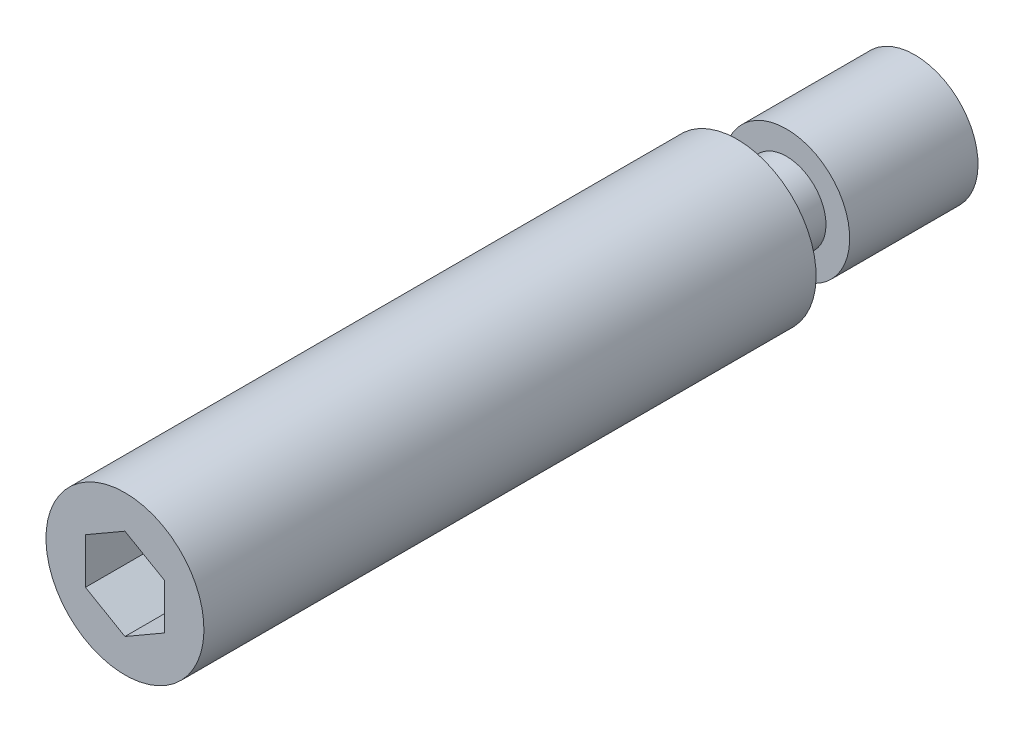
ISO-10303-21;
HEADER;
FILE_DESCRIPTION(('STEP AP214'),'2;1');
FILE_NAME('part.step','',(''),(''),'','','');
FILE_SCHEMA(('AUTOMOTIVE_DESIGN { 1 0 10303 214 1 1 1 1 }'));
ENDSEC;
DATA;
#1=APPLICATION_CONTEXT('core data for automotive mechanical design processes');
#2=APPLICATION_PROTOCOL_DEFINITION('international standard','automotive_design',2000,#1);
#3=PRODUCT_CONTEXT('',#1,'mechanical');
#4=PRODUCT('Part','Part','',(#3));
#5=PRODUCT_RELATED_PRODUCT_CATEGORY('part','',(#4));
#6=PRODUCT_DEFINITION_FORMATION('','',#4);
#7=PRODUCT_DEFINITION_CONTEXT('part definition',#1,'design');
#8=PRODUCT_DEFINITION('design','',#6,#7);
#9=PRODUCT_DEFINITION_SHAPE('','',#8);
#10=(LENGTH_UNIT() NAMED_UNIT(*) SI_UNIT(.MILLI.,.METRE.));
#11=(NAMED_UNIT(*) PLANE_ANGLE_UNIT() SI_UNIT($,.RADIAN.));
#12=(NAMED_UNIT(*) SI_UNIT($,.STERADIAN.) SOLID_ANGLE_UNIT());
#13=UNCERTAINTY_MEASURE_WITH_UNIT(LENGTH_MEASURE(1.E-05),#10,'distance_accuracy_value','');
#14=(GEOMETRIC_REPRESENTATION_CONTEXT(3) GLOBAL_UNCERTAINTY_ASSIGNED_CONTEXT((#13)) GLOBAL_UNIT_ASSIGNED_CONTEXT((#10,
#11,#12)) REPRESENTATION_CONTEXT('',''));
#15=CARTESIAN_POINT('',(0.,0.,0.));
#16=DIRECTION('',(0.,0.,1.));
#17=DIRECTION('',(1.,0.,0.));
#18=AXIS2_PLACEMENT_3D('',#15,#16,#17);
#19=CARTESIAN_POINT('',(0.,-4.,9.));
#20=DIRECTION('',(0.,0.,-1.));
#21=DIRECTION('',(0.,-1.,0.));
#22=AXIS2_PLACEMENT_3D('',#19,#20,#21);
#23=PLANE('',#22);
#24=CARTESIAN_POINT('',(0.,0.,9.));
#25=DIRECTION('',(0.,0.,1.));
#26=DIRECTION('',(0.,1.,0.));
#27=AXIS2_PLACEMENT_3D('',#24,#25,#26);
#28=CIRCLE('',#27,2.);
#29=CARTESIAN_POINT('',(0.,2.,9.));
#30=VERTEX_POINT('',#29);
#31=EDGE_CURVE('E115',#30,#30,#28,.T.);
#32=ORIENTED_EDGE('',*,*,#31,.T.);
#33=EDGE_LOOP('',(#32));
#34=FACE_BOUND('',#33,.T.);
#35=CARTESIAN_POINT('',(0.,0.,9.));
#36=DIRECTION('',(0.,0.,1.));
#37=DIRECTION('',(0.,1.,0.));
#38=AXIS2_PLACEMENT_3D('',#35,#36,#37);
#39=CIRCLE('',#38,4.);
#40=CARTESIAN_POINT('',(0.,4.,9.));
#41=VERTEX_POINT('',#40);
#42=EDGE_CURVE('E9',#41,#41,#39,.T.);
#43=ORIENTED_EDGE('',*,*,#42,.F.);
#44=EDGE_LOOP('',(#43));
#45=FACE_BOUND('',#44,.T.);
#46=ADVANCED_FACE('F14',(#34,#45),#23,.T.);
#47=CARTESIAN_POINT('',(0.,0.,20.));
#48=DIRECTION('',(0.,0.,1.));
#49=DIRECTION('',(0.,1.,0.));
#50=AXIS2_PLACEMENT_3D('',#47,#48,#49);
#51=CYLINDRICAL_SURFACE('',#50,4.);
#52=CARTESIAN_POINT('',(0.,0.,40.));
#53=DIRECTION('',(0.,0.,1.));
#54=DIRECTION('',(0.,1.,0.));
#55=AXIS2_PLACEMENT_3D('',#52,#53,#54);
#56=CIRCLE('',#55,4.);
#57=CARTESIAN_POINT('',(0.,4.,40.));
#58=VERTEX_POINT('',#57);
#59=EDGE_CURVE('E21',#58,#58,#56,.T.);
#60=ORIENTED_EDGE('',*,*,#59,.F.);
#61=EDGE_LOOP('',(#60));
#62=FACE_BOUND('',#61,.T.);
#63=ORIENTED_EDGE('',*,*,#42,.T.);
#64=EDGE_LOOP('',(#63));
#65=FACE_BOUND('',#64,.T.);
#66=ADVANCED_FACE('F136',(#62,#65),#51,.T.);
#67=CARTESIAN_POINT('',(0.,-4.,40.));
#68=DIRECTION('',(0.,0.,-1.));
#69=DIRECTION('',(0.,-1.,0.));
#70=AXIS2_PLACEMENT_3D('',#67,#68,#69);
#71=PLANE('',#70);
#72=DIRECTION('',(-0.866025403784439,-0.5,0.));
#73=VECTOR('',#72,1.);
#74=CARTESIAN_POINT('',(0.,2.30940107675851,40.));
#75=LINE('',#74,#73);
#76=CARTESIAN_POINT('',(0.,2.30940107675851,40.));
#77=VERTEX_POINT('',#76);
#78=CARTESIAN_POINT('',(-2.,1.15470053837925,40.));
#79=VERTEX_POINT('',#78);
#80=EDGE_CURVE('E102',#77,#79,#75,.T.);
#81=ORIENTED_EDGE('',*,*,#80,.F.);
#82=DIRECTION('',(-0.866025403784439,0.5,0.));
#83=VECTOR('',#82,1.);
#84=CARTESIAN_POINT('',(2.,1.15470053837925,40.));
#85=LINE('',#84,#83);
#86=CARTESIAN_POINT('',(2.,1.15470053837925,40.));
#87=VERTEX_POINT('',#86);
#88=EDGE_CURVE('E28',#87,#77,#85,.T.);
#89=ORIENTED_EDGE('',*,*,#88,.F.);
#90=DIRECTION('',(0.,1.,0.));
#91=VECTOR('',#90,1.);
#92=CARTESIAN_POINT('',(2.,-1.15470053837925,40.));
#93=LINE('',#92,#91);
#94=CARTESIAN_POINT('',(2.,-1.15470053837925,40.));
#95=VERTEX_POINT('',#94);
#96=EDGE_CURVE('E111',#95,#87,#93,.T.);
#97=ORIENTED_EDGE('',*,*,#96,.F.);
#98=DIRECTION('',(0.866025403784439,0.5,0.));
#99=VECTOR('',#98,1.);
#100=CARTESIAN_POINT('',(0.,-2.30940107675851,40.));
#101=LINE('',#100,#99);
#102=CARTESIAN_POINT('',(0.,-2.30940107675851,40.));
#103=VERTEX_POINT('',#102);
#104=EDGE_CURVE('E109',#103,#95,#101,.T.);
#105=ORIENTED_EDGE('',*,*,#104,.F.);
#106=DIRECTION('',(0.866025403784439,-0.5,0.));
#107=VECTOR('',#106,1.);
#108=CARTESIAN_POINT('',(-2.,-1.15470053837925,40.));
#109=LINE('',#108,#107);
#110=CARTESIAN_POINT('',(-2.,-1.15470053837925,40.));
#111=VERTEX_POINT('',#110);
#112=EDGE_CURVE('E76',#111,#103,#109,.T.);
#113=ORIENTED_EDGE('',*,*,#112,.F.);
#114=DIRECTION('',(0.,-1.,0.));
#115=VECTOR('',#114,1.);
#116=CARTESIAN_POINT('',(-2.,1.15470053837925,40.));
#117=LINE('',#116,#115);
#118=EDGE_CURVE('E105',#79,#111,#117,.T.);
#119=ORIENTED_EDGE('',*,*,#118,.F.);
#120=EDGE_LOOP('',(#81,#89,#97,#105,#113,#119));
#121=FACE_BOUND('',#120,.T.);
#122=ORIENTED_EDGE('',*,*,#59,.T.);
#123=EDGE_LOOP('',(#122));
#124=FACE_BOUND('',#123,.T.);
#125=ADVANCED_FACE('F134',(#121,#124),#71,.F.);
#126=CARTESIAN_POINT('',(0.,-3.2,0.));
#127=DIRECTION('',(0.,0.,-1.));
#128=DIRECTION('',(0.,-1.,0.));
#129=AXIS2_PLACEMENT_3D('',#126,#127,#128);
#130=PLANE('',#129);
#131=CARTESIAN_POINT('',(0.,0.,0.));
#132=DIRECTION('',(0.,0.,1.));
#133=DIRECTION('',(0.,1.,0.));
#134=AXIS2_PLACEMENT_3D('',#131,#132,#133);
#135=CIRCLE('',#134,3.2);
#136=CARTESIAN_POINT('',(0.,3.2,0.));
#137=VERTEX_POINT('',#136);
#138=EDGE_CURVE('E129',#137,#137,#135,.T.);
#139=ORIENTED_EDGE('',*,*,#138,.F.);
#140=EDGE_LOOP('',(#139));
#141=FACE_BOUND('',#140,.T.);
#142=ADVANCED_FACE('F167',(#141),#130,.T.);
#143=CARTESIAN_POINT('',(0.,0.,20.));
#144=DIRECTION('',(0.,0.,1.));
#145=DIRECTION('',(0.,1.,0.));
#146=AXIS2_PLACEMENT_3D('',#143,#144,#145);
#147=CYLINDRICAL_SURFACE('',#146,3.2);
#148=ORIENTED_EDGE('',*,*,#138,.T.);
#149=EDGE_LOOP('',(#148));
#150=FACE_BOUND('',#149,.T.);
#151=CARTESIAN_POINT('',(0.,0.,6.5));
#152=DIRECTION('',(0.,0.,1.));
#153=DIRECTION('',(0.,1.,0.));
#154=AXIS2_PLACEMENT_3D('',#151,#152,#153);
#155=CIRCLE('',#154,3.2);
#156=CARTESIAN_POINT('',(0.,3.2,6.5));
#157=VERTEX_POINT('',#156);
#158=EDGE_CURVE('E126',#157,#157,#155,.T.);
#159=ORIENTED_EDGE('',*,*,#158,.F.);
#160=EDGE_LOOP('',(#159));
#161=FACE_BOUND('',#160,.T.);
#162=ADVANCED_FACE('F160',(#150,#161),#147,.T.);
#163=CARTESIAN_POINT('',(0.,-2.,6.5));
#164=DIRECTION('',(0.,0.,1.));
#165=DIRECTION('',(0.,1.,0.));
#166=AXIS2_PLACEMENT_3D('',#163,#164,#165);
#167=PLANE('',#166);
#168=ORIENTED_EDGE('',*,*,#158,.T.);
#169=EDGE_LOOP('',(#168));
#170=FACE_BOUND('',#169,.T.);
#171=CARTESIAN_POINT('',(0.,0.,6.5));
#172=DIRECTION('',(0.,0.,1.));
#173=DIRECTION('',(0.,1.,0.));
#174=AXIS2_PLACEMENT_3D('',#171,#172,#173);
#175=CIRCLE('',#174,2.);
#176=CARTESIAN_POINT('',(0.,2.,6.5));
#177=VERTEX_POINT('',#176);
#178=EDGE_CURVE('E123',#177,#177,#175,.T.);
#179=ORIENTED_EDGE('',*,*,#178,.F.);
#180=EDGE_LOOP('',(#179));
#181=FACE_BOUND('',#180,.T.);
#182=ADVANCED_FACE('F151',(#170,#181),#167,.T.);
#183=CARTESIAN_POINT('',(0.,0.,20.));
#184=DIRECTION('',(0.,0.,1.));
#185=DIRECTION('',(0.,1.,0.));
#186=AXIS2_PLACEMENT_3D('',#183,#184,#185);
#187=CYLINDRICAL_SURFACE('',#186,2.);
#188=ORIENTED_EDGE('',*,*,#178,.T.);
#189=EDGE_LOOP('',(#188));
#190=FACE_BOUND('',#189,.T.);
#191=ORIENTED_EDGE('',*,*,#31,.F.);
#192=EDGE_LOOP('',(#191));
#193=FACE_BOUND('',#192,.T.);
#194=ADVANCED_FACE('F148',(#190,#193),#187,.T.);
#195=CARTESIAN_POINT('',(2.,1.15470053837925,35.));
#196=DIRECTION('',(0.5,0.866025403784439,0.));
#197=DIRECTION('',(-0.866025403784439,0.5,0.));
#198=AXIS2_PLACEMENT_3D('',#195,#196,#197);
#199=PLANE('',#198);
#200=ORIENTED_EDGE('',*,*,#88,.T.);
#201=DIRECTION('',(0.,0.,1.));
#202=VECTOR('',#201,1.);
#203=CARTESIAN_POINT('',(0.,2.30940107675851,35.));
#204=LINE('',#203,#202);
#205=CARTESIAN_POINT('',(0.,2.30940107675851,35.));
#206=VERTEX_POINT('',#205);
#207=EDGE_CURVE('E58',#206,#77,#204,.T.);
#208=ORIENTED_EDGE('',*,*,#207,.F.);
#209=DIRECTION('',(-0.866025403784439,0.5,0.));
#210=VECTOR('',#209,1.);
#211=CARTESIAN_POINT('',(2.,1.15470053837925,35.));
#212=LINE('',#211,#210);
#213=CARTESIAN_POINT('',(2.,1.15470053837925,35.));
#214=VERTEX_POINT('',#213);
#215=EDGE_CURVE('E113',#214,#206,#212,.T.);
#216=ORIENTED_EDGE('',*,*,#215,.F.);
#217=DIRECTION('',(0.,0.,1.));
#218=VECTOR('',#217,1.);
#219=CARTESIAN_POINT('',(2.,1.15470053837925,35.));
#220=LINE('',#219,#218);
#221=EDGE_CURVE('E36',#214,#87,#220,.T.);
#222=ORIENTED_EDGE('',*,*,#221,.T.);
#223=EDGE_LOOP('',(#200,#208,#216,#222));
#224=FACE_BOUND('',#223,.T.);
#225=ADVANCED_FACE('F150',(#224),#199,.F.);
#226=CARTESIAN_POINT('',(2.,-1.15470053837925,35.));
#227=DIRECTION('',(1.,0.,0.));
#228=DIRECTION('',(0.,0.,-1.));
#229=AXIS2_PLACEMENT_3D('',#226,#227,#228);
#230=PLANE('',#229);
#231=ORIENTED_EDGE('',*,*,#96,.T.);
#232=ORIENTED_EDGE('',*,*,#221,.F.);
#233=DIRECTION('',(0.,1.,0.));
#234=VECTOR('',#233,1.);
#235=CARTESIAN_POINT('',(2.,-1.15470053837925,35.));
#236=LINE('',#235,#234);
#237=CARTESIAN_POINT('',(2.,-1.15470053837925,35.));
#238=VERTEX_POINT('',#237);
#239=EDGE_CURVE('E88',#238,#214,#236,.T.);
#240=ORIENTED_EDGE('',*,*,#239,.F.);
#241=DIRECTION('',(0.,0.,1.));
#242=VECTOR('',#241,1.);
#243=CARTESIAN_POINT('',(2.,-1.15470053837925,35.));
#244=LINE('',#243,#242);
#245=EDGE_CURVE('E80',#238,#95,#244,.T.);
#246=ORIENTED_EDGE('',*,*,#245,.T.);
#247=EDGE_LOOP('',(#231,#232,#240,#246));
#248=FACE_BOUND('',#247,.T.);
#249=ADVANCED_FACE('F158',(#248),#230,.F.);
#250=CARTESIAN_POINT('',(0.,-2.30940107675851,35.));
#251=DIRECTION('',(0.5,-0.866025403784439,0.));
#252=DIRECTION('',(0.866025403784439,0.5,0.));
#253=AXIS2_PLACEMENT_3D('',#250,#251,#252);
#254=PLANE('',#253);
#255=ORIENTED_EDGE('',*,*,#104,.T.);
#256=ORIENTED_EDGE('',*,*,#245,.F.);
#257=DIRECTION('',(0.866025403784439,0.5,0.));
#258=VECTOR('',#257,1.);
#259=CARTESIAN_POINT('',(0.,-2.30940107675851,35.));
#260=LINE('',#259,#258);
#261=CARTESIAN_POINT('',(0.,-2.30940107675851,35.));
#262=VERTEX_POINT('',#261);
#263=EDGE_CURVE('E84',#262,#238,#260,.T.);
#264=ORIENTED_EDGE('',*,*,#263,.F.);
#265=DIRECTION('',(0.,0.,1.));
#266=VECTOR('',#265,1.);
#267=CARTESIAN_POINT('',(0.,-2.30940107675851,35.));
#268=LINE('',#267,#266);
#269=EDGE_CURVE('E69',#262,#103,#268,.T.);
#270=ORIENTED_EDGE('',*,*,#269,.T.);
#271=EDGE_LOOP('',(#255,#256,#264,#270));
#272=FACE_BOUND('',#271,.T.);
#273=ADVANCED_FACE('F85',(#272),#254,.F.);
#274=CARTESIAN_POINT('',(-2.,-1.15470053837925,35.));
#275=DIRECTION('',(-0.5,-0.866025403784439,0.));
#276=DIRECTION('',(0.866025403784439,-0.5,0.));
#277=AXIS2_PLACEMENT_3D('',#274,#275,#276);
#278=PLANE('',#277);
#279=ORIENTED_EDGE('',*,*,#112,.T.);
#280=ORIENTED_EDGE('',*,*,#269,.F.);
#281=DIRECTION('',(0.866025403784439,-0.5,0.));
#282=VECTOR('',#281,1.);
#283=CARTESIAN_POINT('',(-2.,-1.15470053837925,35.));
#284=LINE('',#283,#282);
#285=CARTESIAN_POINT('',(-2.,-1.15470053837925,35.));
#286=VERTEX_POINT('',#285);
#287=EDGE_CURVE('E73',#286,#262,#284,.T.);
#288=ORIENTED_EDGE('',*,*,#287,.F.);
#289=DIRECTION('',(0.,0.,1.));
#290=VECTOR('',#289,1.);
#291=CARTESIAN_POINT('',(-2.,-1.15470053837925,35.));
#292=LINE('',#291,#290);
#293=EDGE_CURVE('E81',#286,#111,#292,.T.);
#294=ORIENTED_EDGE('',*,*,#293,.T.);
#295=EDGE_LOOP('',(#279,#280,#288,#294));
#296=FACE_BOUND('',#295,.T.);
#297=ADVANCED_FACE('F71',(#296),#278,.F.);
#298=CARTESIAN_POINT('',(-2.,1.15470053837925,35.));
#299=DIRECTION('',(-1.,0.,0.));
#300=DIRECTION('',(0.,-1.,0.));
#301=AXIS2_PLACEMENT_3D('',#298,#299,#300);
#302=PLANE('',#301);
#303=ORIENTED_EDGE('',*,*,#118,.T.);
#304=ORIENTED_EDGE('',*,*,#293,.F.);
#305=DIRECTION('',(0.,-1.,0.));
#306=VECTOR('',#305,1.);
#307=CARTESIAN_POINT('',(-2.,1.15470053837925,35.));
#308=LINE('',#307,#306);
#309=CARTESIAN_POINT('',(-2.,1.15470053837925,35.));
#310=VERTEX_POINT('',#309);
#311=EDGE_CURVE('E94',#310,#286,#308,.T.);
#312=ORIENTED_EDGE('',*,*,#311,.F.);
#313=DIRECTION('',(0.,0.,1.));
#314=VECTOR('',#313,1.);
#315=CARTESIAN_POINT('',(-2.,1.15470053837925,35.));
#316=LINE('',#315,#314);
#317=EDGE_CURVE('E118',#310,#79,#316,.T.);
#318=ORIENTED_EDGE('',*,*,#317,.T.);
#319=EDGE_LOOP('',(#303,#304,#312,#318));
#320=FACE_BOUND('',#319,.T.);
#321=ADVANCED_FACE('F192',(#320),#302,.F.);
#322=CARTESIAN_POINT('',(0.,2.30940107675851,35.));
#323=DIRECTION('',(-0.5,0.866025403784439,0.));
#324=DIRECTION('',(-0.866025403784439,-0.5,0.));
#325=AXIS2_PLACEMENT_3D('',#322,#323,#324);
#326=PLANE('',#325);
#327=ORIENTED_EDGE('',*,*,#80,.T.);
#328=ORIENTED_EDGE('',*,*,#317,.F.);
#329=DIRECTION('',(-0.866025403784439,-0.5,0.));
#330=VECTOR('',#329,1.);
#331=CARTESIAN_POINT('',(0.,2.30940107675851,35.));
#332=LINE('',#331,#330);
#333=EDGE_CURVE('E96',#206,#310,#332,.T.);
#334=ORIENTED_EDGE('',*,*,#333,.F.);
#335=ORIENTED_EDGE('',*,*,#207,.T.);
#336=EDGE_LOOP('',(#327,#328,#334,#335));
#337=FACE_BOUND('',#336,.T.);
#338=ADVANCED_FACE('F180',(#337),#326,.F.);
#339=CARTESIAN_POINT('',(0.,2.30940107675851,35.));
#340=DIRECTION('',(0.,0.,1.));
#341=DIRECTION('',(1.,0.,0.));
#342=AXIS2_PLACEMENT_3D('',#339,#340,#341);
#343=PLANE('',#342);
#344=ORIENTED_EDGE('',*,*,#215,.T.);
#345=ORIENTED_EDGE('',*,*,#333,.T.);
#346=ORIENTED_EDGE('',*,*,#311,.T.);
#347=ORIENTED_EDGE('',*,*,#287,.T.);
#348=ORIENTED_EDGE('',*,*,#263,.T.);
#349=ORIENTED_EDGE('',*,*,#239,.T.);
#350=EDGE_LOOP('',(#344,#345,#346,#347,#348,#349));
#351=FACE_BOUND('',#350,.T.);
#352=ADVANCED_FACE('F91',(#351),#343,.T.);
#353=CLOSED_SHELL('',(#46,#66,#125,#142,#162,#182,#194,#225,#249,#273,#297,#321,#338,#352));
#354=MANIFOLD_SOLID_BREP('B1',#353);
#355=ADVANCED_BREP_SHAPE_REPRESENTATION('',(#18,#354),#14);
#356=SHAPE_DEFINITION_REPRESENTATION(#9,#355);
ENDSEC;
END-ISO-10303-21;
